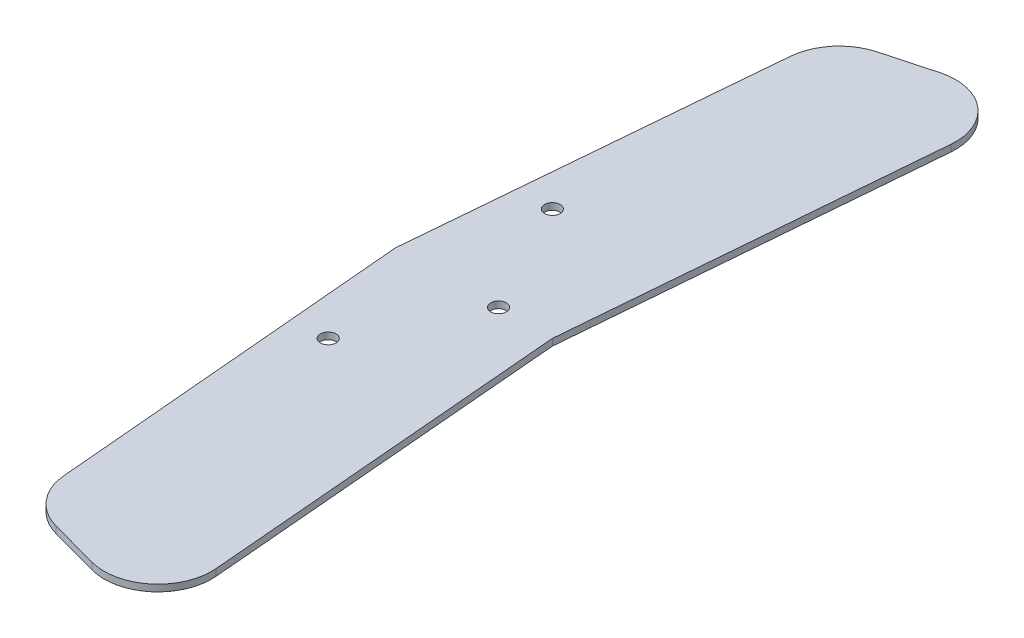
ISO-10303-21;
HEADER;
FILE_DESCRIPTION(('STEP AP214'),'2;1');
FILE_NAME('part.step','',(''),(''),'','','');
FILE_SCHEMA(('AUTOMOTIVE_DESIGN { 1 0 10303 214 1 1 1 1 }'));
ENDSEC;
DATA;
#1=APPLICATION_CONTEXT('core data for automotive mechanical design processes');
#2=APPLICATION_PROTOCOL_DEFINITION('international standard','automotive_design',2000,#1);
#3=PRODUCT_CONTEXT('',#1,'mechanical');
#4=PRODUCT('Part','Part','',(#3));
#5=PRODUCT_RELATED_PRODUCT_CATEGORY('part','',(#4));
#6=PRODUCT_DEFINITION_FORMATION('','',#4);
#7=PRODUCT_DEFINITION_CONTEXT('part definition',#1,'design');
#8=PRODUCT_DEFINITION('design','',#6,#7);
#9=PRODUCT_DEFINITION_SHAPE('','',#8);
#10=(LENGTH_UNIT() NAMED_UNIT(*) SI_UNIT(.MILLI.,.METRE.));
#11=(NAMED_UNIT(*) PLANE_ANGLE_UNIT() SI_UNIT($,.RADIAN.));
#12=(NAMED_UNIT(*) SI_UNIT($,.STERADIAN.) SOLID_ANGLE_UNIT());
#13=UNCERTAINTY_MEASURE_WITH_UNIT(LENGTH_MEASURE(1.E-05),#10,'distance_accuracy_value','');
#14=(GEOMETRIC_REPRESENTATION_CONTEXT(3) GLOBAL_UNCERTAINTY_ASSIGNED_CONTEXT((#13)) GLOBAL_UNIT_ASSIGNED_CONTEXT((#10,
#11,#12)) REPRESENTATION_CONTEXT('',''));
#15=CARTESIAN_POINT('',(0.,0.,0.));
#16=DIRECTION('',(0.,0.,1.));
#17=DIRECTION('',(1.,0.,0.));
#18=AXIS2_PLACEMENT_3D('',#15,#16,#17);
#19=CARTESIAN_POINT('',(19.,1.5,80.));
#20=DIRECTION('',(0.,-1.,0.));
#21=DIRECTION('',(0.,0.,-1.));
#22=AXIS2_PLACEMENT_3D('',#19,#20,#21);
#23=PLANE('',#22);
#24=CARTESIAN_POINT('',(23.,1.5,0.));
#25=DIRECTION('',(0.,1.,0.));
#26=DIRECTION('',(0.,0.,1.));
#27=AXIS2_PLACEMENT_3D('',#24,#25,#26);
#28=CIRCLE('',#27,1.75);
#29=CARTESIAN_POINT('',(23.,1.5,1.75));
#30=VERTEX_POINT('',#29);
#31=EDGE_CURVE('E263',#30,#30,#28,.T.);
#32=ORIENTED_EDGE('',*,*,#31,.F.);
#33=EDGE_LOOP('',(#32));
#34=FACE_BOUND('',#33,.T.);
#35=DIRECTION('',(0.0866075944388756,0.,0.996242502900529));
#36=VECTOR('',#35,1.);
#37=CARTESIAN_POINT('',(0.,1.5,0.));
#38=LINE('',#37,#36);
#39=CARTESIAN_POINT('',(0.,1.5,0.));
#40=VERTEX_POINT('',#39);
#41=CARTESIAN_POINT('',(7.04508996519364,1.5,81.0392911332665));
#42=VERTEX_POINT('',#41);
#43=EDGE_CURVE('E148',#40,#42,#38,.T.);
#44=ORIENTED_EDGE('',*,*,#43,.T.);
#45=CARTESIAN_POINT('',(19.,1.5,80.));
#46=DIRECTION('',(0.,1.,0.));
#47=DIRECTION('',(0.,0.,-1.));
#48=AXIS2_PLACEMENT_3D('',#45,#46,#47);
#49=CIRCLE('',#48,12.);
#50=CARTESIAN_POINT('',(15.8425911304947,1.5,91.5771658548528));
#51=VERTEX_POINT('',#50);
#52=EDGE_CURVE('E121',#42,#51,#49,.T.);
#53=ORIENTED_EDGE('',*,*,#52,.T.);
#54=DIRECTION('',(0.964763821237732,0.,0.263117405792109));
#55=VECTOR('',#54,1.);
#56=CARTESIAN_POINT('',(15.8425911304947,1.5,91.5771658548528));
#57=LINE('',#56,#55);
#58=CARTESIAN_POINT('',(26.8425911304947,1.5,94.5771658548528));
#59=VERTEX_POINT('',#58);
#60=EDGE_CURVE('E151',#51,#59,#57,.T.);
#61=ORIENTED_EDGE('',*,*,#60,.T.);
#62=CARTESIAN_POINT('',(30.,1.5,83.));
#63=DIRECTION('',(0.,1.,0.));
#64=DIRECTION('',(0.,0.,-1.));
#65=AXIS2_PLACEMENT_3D('',#62,#63,#64);
#66=CIRCLE('',#65,12.);
#67=CARTESIAN_POINT('',(41.9570277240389,1.5,81.985363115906));
#68=VERTEX_POINT('',#67);
#69=EDGE_CURVE('E153',#59,#68,#66,.T.);
#70=ORIENTED_EDGE('',*,*,#69,.T.);
#71=DIRECTION('',(-0.0845530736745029,0.,-0.996418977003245));
#72=VECTOR('',#71,1.);
#73=CARTESIAN_POINT('',(35.,1.5,0.));
#74=LINE('',#73,#72);
#75=CARTESIAN_POINT('',(35.,1.5,0.));
#76=VERTEX_POINT('',#75);
#77=EDGE_CURVE('E155',#68,#76,#74,.T.);
#78=ORIENTED_EDGE('',*,*,#77,.T.);
#79=DIRECTION('',(0.0845530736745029,0.,-0.996418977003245));
#80=VECTOR('',#79,1.);
#81=CARTESIAN_POINT('',(35.,1.5,0.));
#82=LINE('',#81,#80);
#83=CARTESIAN_POINT('',(41.9570277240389,1.5,-81.985363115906));
#84=VERTEX_POINT('',#83);
#85=EDGE_CURVE('E157',#76,#84,#82,.T.);
#86=ORIENTED_EDGE('',*,*,#85,.T.);
#87=CARTESIAN_POINT('',(30.,1.5,-83.));
#88=DIRECTION('',(0.,1.,0.));
#89=DIRECTION('',(0.,0.,1.));
#90=AXIS2_PLACEMENT_3D('',#87,#88,#89);
#91=CIRCLE('',#90,12.);
#92=CARTESIAN_POINT('',(26.8425911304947,1.5,-94.5771658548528));
#93=VERTEX_POINT('',#92);
#94=EDGE_CURVE('E159',#84,#93,#91,.T.);
#95=ORIENTED_EDGE('',*,*,#94,.T.);
#96=DIRECTION('',(-0.964763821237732,0.,0.263117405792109));
#97=VECTOR('',#96,1.);
#98=CARTESIAN_POINT('',(15.8425911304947,1.5,-91.5771658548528));
#99=LINE('',#98,#97);
#100=CARTESIAN_POINT('',(15.8425911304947,1.5,-91.5771658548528));
#101=VERTEX_POINT('',#100);
#102=EDGE_CURVE('E161',#93,#101,#99,.T.);
#103=ORIENTED_EDGE('',*,*,#102,.T.);
#104=CARTESIAN_POINT('',(19.,1.5,-80.));
#105=DIRECTION('',(0.,1.,0.));
#106=DIRECTION('',(0.,0.,1.));
#107=AXIS2_PLACEMENT_3D('',#104,#105,#106);
#108=CIRCLE('',#107,12.);
#109=CARTESIAN_POINT('',(7.04508996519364,1.5,-81.0392911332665));
#110=VERTEX_POINT('',#109);
#111=EDGE_CURVE('E50',#101,#110,#108,.T.);
#112=ORIENTED_EDGE('',*,*,#111,.T.);
#113=DIRECTION('',(-0.0866075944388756,0.,0.996242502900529));
#114=VECTOR('',#113,1.);
#115=CARTESIAN_POINT('',(0.,1.5,0.));
#116=LINE('',#115,#114);
#117=EDGE_CURVE('E45',#110,#40,#116,.T.);
#118=ORIENTED_EDGE('',*,*,#117,.T.);
#119=EDGE_LOOP('',(#44,#53,#61,#70,#78,#86,#95,#103,#112,#118));
#120=FACE_BOUND('',#119,.T.);
#121=CARTESIAN_POINT('',(10.,1.5,25.));
#122=DIRECTION('',(0.,1.,0.));
#123=DIRECTION('',(0.,0.,-1.));
#124=AXIS2_PLACEMENT_3D('',#121,#122,#123);
#125=CIRCLE('',#124,1.75);
#126=CARTESIAN_POINT('',(10.,1.5,23.25));
#127=VERTEX_POINT('',#126);
#128=EDGE_CURVE('E126',#127,#127,#125,.T.);
#129=ORIENTED_EDGE('',*,*,#128,.F.);
#130=EDGE_LOOP('',(#129));
#131=FACE_BOUND('',#130,.T.);
#132=CARTESIAN_POINT('',(10.,1.5,-25.));
#133=DIRECTION('',(0.,1.,0.));
#134=DIRECTION('',(0.,0.,1.));
#135=AXIS2_PLACEMENT_3D('',#132,#133,#134);
#136=CIRCLE('',#135,1.75);
#137=CARTESIAN_POINT('',(10.,1.5,-23.25));
#138=VERTEX_POINT('',#137);
#139=EDGE_CURVE('E252',#138,#138,#136,.T.);
#140=ORIENTED_EDGE('',*,*,#139,.F.);
#141=EDGE_LOOP('',(#140));
#142=FACE_BOUND('',#141,.T.);
#143=ADVANCED_FACE('F30',(#34,#120,#131,#142),#23,.F.);
#144=CARTESIAN_POINT('',(19.,0.,80.));
#145=DIRECTION('',(0.,-1.,0.));
#146=DIRECTION('',(0.,0.,-1.));
#147=AXIS2_PLACEMENT_3D('',#144,#145,#146);
#148=PLANE('',#147);
#149=CARTESIAN_POINT('',(23.,0.,0.));
#150=DIRECTION('',(0.,1.,0.));
#151=DIRECTION('',(0.,0.,1.));
#152=AXIS2_PLACEMENT_3D('',#149,#150,#151);
#153=CIRCLE('',#152,1.75);
#154=CARTESIAN_POINT('',(23.,0.,1.75));
#155=VERTEX_POINT('',#154);
#156=EDGE_CURVE('E258',#155,#155,#153,.T.);
#157=ORIENTED_EDGE('',*,*,#156,.T.);
#158=EDGE_LOOP('',(#157));
#159=FACE_BOUND('',#158,.T.);
#160=DIRECTION('',(0.0866075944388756,0.,0.996242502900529));
#161=VECTOR('',#160,1.);
#162=CARTESIAN_POINT('',(0.,0.,0.));
#163=LINE('',#162,#161);
#164=CARTESIAN_POINT('',(0.,0.,0.));
#165=VERTEX_POINT('',#164);
#166=CARTESIAN_POINT('',(7.04508996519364,0.,81.0392911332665));
#167=VERTEX_POINT('',#166);
#168=EDGE_CURVE('E112',#165,#167,#163,.T.);
#169=ORIENTED_EDGE('',*,*,#168,.F.);
#170=DIRECTION('',(-0.0866075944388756,0.,0.996242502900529));
#171=VECTOR('',#170,1.);
#172=CARTESIAN_POINT('',(0.,0.,0.));
#173=LINE('',#172,#171);
#174=CARTESIAN_POINT('',(7.04508996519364,0.,-81.0392911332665));
#175=VERTEX_POINT('',#174);
#176=EDGE_CURVE('E146',#175,#165,#173,.T.);
#177=ORIENTED_EDGE('',*,*,#176,.F.);
#178=CARTESIAN_POINT('',(19.,0.,-80.));
#179=DIRECTION('',(0.,1.,0.));
#180=DIRECTION('',(0.,0.,1.));
#181=AXIS2_PLACEMENT_3D('',#178,#179,#180);
#182=CIRCLE('',#181,12.);
#183=CARTESIAN_POINT('',(15.8425911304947,0.,-91.5771658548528));
#184=VERTEX_POINT('',#183);
#185=EDGE_CURVE('E144',#184,#175,#182,.T.);
#186=ORIENTED_EDGE('',*,*,#185,.F.);
#187=DIRECTION('',(-0.964763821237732,0.,0.263117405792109));
#188=VECTOR('',#187,1.);
#189=CARTESIAN_POINT('',(15.8425911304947,0.,-91.5771658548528));
#190=LINE('',#189,#188);
#191=CARTESIAN_POINT('',(26.8425911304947,0.,-94.5771658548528));
#192=VERTEX_POINT('',#191);
#193=EDGE_CURVE('E142',#192,#184,#190,.T.);
#194=ORIENTED_EDGE('',*,*,#193,.F.);
#195=CARTESIAN_POINT('',(30.,0.,-83.));
#196=DIRECTION('',(0.,1.,0.));
#197=DIRECTION('',(0.,0.,1.));
#198=AXIS2_PLACEMENT_3D('',#195,#196,#197);
#199=CIRCLE('',#198,12.);
#200=CARTESIAN_POINT('',(41.9570277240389,0.,-81.985363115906));
#201=VERTEX_POINT('',#200);
#202=EDGE_CURVE('E140',#201,#192,#199,.T.);
#203=ORIENTED_EDGE('',*,*,#202,.F.);
#204=DIRECTION('',(0.0845530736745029,0.,-0.996418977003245));
#205=VECTOR('',#204,1.);
#206=CARTESIAN_POINT('',(35.,0.,0.));
#207=LINE('',#206,#205);
#208=CARTESIAN_POINT('',(35.,0.,0.));
#209=VERTEX_POINT('',#208);
#210=EDGE_CURVE('E138',#209,#201,#207,.T.);
#211=ORIENTED_EDGE('',*,*,#210,.F.);
#212=DIRECTION('',(-0.0845530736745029,0.,-0.996418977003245));
#213=VECTOR('',#212,1.);
#214=CARTESIAN_POINT('',(35.,0.,0.));
#215=LINE('',#214,#213);
#216=CARTESIAN_POINT('',(41.9570277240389,0.,81.985363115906));
#217=VERTEX_POINT('',#216);
#218=EDGE_CURVE('E136',#217,#209,#215,.T.);
#219=ORIENTED_EDGE('',*,*,#218,.F.);
#220=CARTESIAN_POINT('',(30.,0.,83.));
#221=DIRECTION('',(0.,1.,0.));
#222=DIRECTION('',(0.,0.,-1.));
#223=AXIS2_PLACEMENT_3D('',#220,#221,#222);
#224=CIRCLE('',#223,12.);
#225=CARTESIAN_POINT('',(26.8425911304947,0.,94.5771658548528));
#226=VERTEX_POINT('',#225);
#227=EDGE_CURVE('E134',#226,#217,#224,.T.);
#228=ORIENTED_EDGE('',*,*,#227,.F.);
#229=DIRECTION('',(0.964763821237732,0.,0.263117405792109));
#230=VECTOR('',#229,1.);
#231=CARTESIAN_POINT('',(15.8425911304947,0.,91.5771658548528));
#232=LINE('',#231,#230);
#233=CARTESIAN_POINT('',(15.8425911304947,0.,91.5771658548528));
#234=VERTEX_POINT('',#233);
#235=EDGE_CURVE('E114',#234,#226,#232,.T.);
#236=ORIENTED_EDGE('',*,*,#235,.F.);
#237=CARTESIAN_POINT('',(19.,0.,80.));
#238=DIRECTION('',(0.,1.,0.));
#239=DIRECTION('',(0.,0.,-1.));
#240=AXIS2_PLACEMENT_3D('',#237,#238,#239);
#241=CIRCLE('',#240,12.);
#242=EDGE_CURVE('E107',#167,#234,#241,.T.);
#243=ORIENTED_EDGE('',*,*,#242,.F.);
#244=EDGE_LOOP('',(#169,#177,#186,#194,#203,#211,#219,#228,#236,#243));
#245=FACE_BOUND('',#244,.T.);
#246=CARTESIAN_POINT('',(10.,0.,25.));
#247=DIRECTION('',(0.,1.,0.));
#248=DIRECTION('',(0.,0.,-1.));
#249=AXIS2_PLACEMENT_3D('',#246,#247,#248);
#250=CIRCLE('',#249,1.75);
#251=CARTESIAN_POINT('',(10.,0.,23.25));
#252=VERTEX_POINT('',#251);
#253=EDGE_CURVE('E129',#252,#252,#250,.T.);
#254=ORIENTED_EDGE('',*,*,#253,.T.);
#255=EDGE_LOOP('',(#254));
#256=FACE_BOUND('',#255,.T.);
#257=CARTESIAN_POINT('',(10.,0.,-25.));
#258=DIRECTION('',(0.,1.,0.));
#259=DIRECTION('',(0.,0.,1.));
#260=AXIS2_PLACEMENT_3D('',#257,#258,#259);
#261=CIRCLE('',#260,1.75);
#262=CARTESIAN_POINT('',(10.,0.,-23.25));
#263=VERTEX_POINT('',#262);
#264=EDGE_CURVE('E255',#263,#263,#261,.T.);
#265=ORIENTED_EDGE('',*,*,#264,.T.);
#266=EDGE_LOOP('',(#265));
#267=FACE_BOUND('',#266,.T.);
#268=ADVANCED_FACE('F108',(#159,#245,#256,#267),#148,.T.);
#269=CARTESIAN_POINT('',(0.,1.5,0.));
#270=DIRECTION('',(0.996242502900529,0.,-0.0866075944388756));
#271=DIRECTION('',(-0.0866075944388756,0.,-0.996242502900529));
#272=AXIS2_PLACEMENT_3D('',#269,#270,#271);
#273=PLANE('',#272);
#274=ORIENTED_EDGE('',*,*,#168,.T.);
#275=DIRECTION('',(0.,-1.,0.));
#276=VECTOR('',#275,1.);
#277=CARTESIAN_POINT('',(7.04508996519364,1.5,81.0392911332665));
#278=LINE('',#277,#276);
#279=EDGE_CURVE('E11',#42,#167,#278,.T.);
#280=ORIENTED_EDGE('',*,*,#279,.F.);
#281=ORIENTED_EDGE('',*,*,#43,.F.);
#282=DIRECTION('',(0.,-1.,0.));
#283=VECTOR('',#282,1.);
#284=CARTESIAN_POINT('',(0.,1.5,0.));
#285=LINE('',#284,#283);
#286=EDGE_CURVE('E125',#40,#165,#285,.T.);
#287=ORIENTED_EDGE('',*,*,#286,.T.);
#288=EDGE_LOOP('',(#274,#280,#281,#287));
#289=FACE_BOUND('',#288,.T.);
#290=ADVANCED_FACE('F32',(#289),#273,.F.);
#291=CARTESIAN_POINT('',(19.,1.5,80.));
#292=DIRECTION('',(0.,-1.,0.));
#293=DIRECTION('',(0.,0.,-1.));
#294=AXIS2_PLACEMENT_3D('',#291,#292,#293);
#295=CYLINDRICAL_SURFACE('',#294,12.);
#296=ORIENTED_EDGE('',*,*,#242,.T.);
#297=DIRECTION('',(0.,-1.,0.));
#298=VECTOR('',#297,1.);
#299=CARTESIAN_POINT('',(15.8425911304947,1.5,91.5771658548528));
#300=LINE('',#299,#298);
#301=EDGE_CURVE('E38',#51,#234,#300,.T.);
#302=ORIENTED_EDGE('',*,*,#301,.F.);
#303=ORIENTED_EDGE('',*,*,#52,.F.);
#304=ORIENTED_EDGE('',*,*,#279,.T.);
#305=EDGE_LOOP('',(#296,#302,#303,#304));
#306=FACE_BOUND('',#305,.T.);
#307=ADVANCED_FACE('F120',(#306),#295,.T.);
#308=CARTESIAN_POINT('',(15.8425911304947,1.5,91.5771658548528));
#309=DIRECTION('',(0.263117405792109,0.,-0.964763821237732));
#310=DIRECTION('',(-0.964763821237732,0.,-0.263117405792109));
#311=AXIS2_PLACEMENT_3D('',#308,#309,#310);
#312=PLANE('',#311);
#313=ORIENTED_EDGE('',*,*,#235,.T.);
#314=DIRECTION('',(0.,-1.,0.));
#315=VECTOR('',#314,1.);
#316=CARTESIAN_POINT('',(26.8425911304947,1.5,94.5771658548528));
#317=LINE('',#316,#315);
#318=EDGE_CURVE('E184',#59,#226,#317,.T.);
#319=ORIENTED_EDGE('',*,*,#318,.F.);
#320=ORIENTED_EDGE('',*,*,#60,.F.);
#321=ORIENTED_EDGE('',*,*,#301,.T.);
#322=EDGE_LOOP('',(#313,#319,#320,#321));
#323=FACE_BOUND('',#322,.T.);
#324=ADVANCED_FACE('F188',(#323),#312,.F.);
#325=CARTESIAN_POINT('',(30.,1.5,83.));
#326=DIRECTION('',(0.,-1.,0.));
#327=DIRECTION('',(0.,0.,-1.));
#328=AXIS2_PLACEMENT_3D('',#325,#326,#327);
#329=CYLINDRICAL_SURFACE('',#328,12.);
#330=ORIENTED_EDGE('',*,*,#227,.T.);
#331=DIRECTION('',(0.,-1.,0.));
#332=VECTOR('',#331,1.);
#333=CARTESIAN_POINT('',(41.9570277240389,1.5,81.985363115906));
#334=LINE('',#333,#332);
#335=EDGE_CURVE('E181',#68,#217,#334,.T.);
#336=ORIENTED_EDGE('',*,*,#335,.F.);
#337=ORIENTED_EDGE('',*,*,#69,.F.);
#338=ORIENTED_EDGE('',*,*,#318,.T.);
#339=EDGE_LOOP('',(#330,#336,#337,#338));
#340=FACE_BOUND('',#339,.T.);
#341=ADVANCED_FACE('F196',(#340),#329,.T.);
#342=CARTESIAN_POINT('',(35.,1.5,0.));
#343=DIRECTION('',(-0.996418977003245,0.,0.0845530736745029));
#344=DIRECTION('',(0.0845530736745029,0.,0.996418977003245));
#345=AXIS2_PLACEMENT_3D('',#342,#343,#344);
#346=PLANE('',#345);
#347=ORIENTED_EDGE('',*,*,#218,.T.);
#348=DIRECTION('',(0.,-1.,0.));
#349=VECTOR('',#348,1.);
#350=CARTESIAN_POINT('',(35.,1.5,0.));
#351=LINE('',#350,#349);
#352=EDGE_CURVE('E178',#76,#209,#351,.T.);
#353=ORIENTED_EDGE('',*,*,#352,.F.);
#354=ORIENTED_EDGE('',*,*,#77,.F.);
#355=ORIENTED_EDGE('',*,*,#335,.T.);
#356=EDGE_LOOP('',(#347,#353,#354,#355));
#357=FACE_BOUND('',#356,.T.);
#358=ADVANCED_FACE('F199',(#357),#346,.F.);
#359=CARTESIAN_POINT('',(35.,1.5,0.));
#360=DIRECTION('',(-0.996418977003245,0.,-0.0845530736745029));
#361=DIRECTION('',(-0.0845530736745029,0.,0.996418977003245));
#362=AXIS2_PLACEMENT_3D('',#359,#360,#361);
#363=PLANE('',#362);
#364=ORIENTED_EDGE('',*,*,#210,.T.);
#365=DIRECTION('',(0.,-1.,0.));
#366=VECTOR('',#365,1.);
#367=CARTESIAN_POINT('',(41.9570277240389,1.5,-81.985363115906));
#368=LINE('',#367,#366);
#369=EDGE_CURVE('E175',#84,#201,#368,.T.);
#370=ORIENTED_EDGE('',*,*,#369,.F.);
#371=ORIENTED_EDGE('',*,*,#85,.F.);
#372=ORIENTED_EDGE('',*,*,#352,.T.);
#373=EDGE_LOOP('',(#364,#370,#371,#372));
#374=FACE_BOUND('',#373,.T.);
#375=ADVANCED_FACE('F204',(#374),#363,.F.);
#376=CARTESIAN_POINT('',(30.,1.5,-83.));
#377=DIRECTION('',(0.,-1.,0.));
#378=DIRECTION('',(0.,0.,-1.));
#379=AXIS2_PLACEMENT_3D('',#376,#377,#378);
#380=CYLINDRICAL_SURFACE('',#379,12.);
#381=ORIENTED_EDGE('',*,*,#202,.T.);
#382=DIRECTION('',(0.,-1.,0.));
#383=VECTOR('',#382,1.);
#384=CARTESIAN_POINT('',(26.8425911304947,1.5,-94.5771658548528));
#385=LINE('',#384,#383);
#386=EDGE_CURVE('E172',#93,#192,#385,.T.);
#387=ORIENTED_EDGE('',*,*,#386,.F.);
#388=ORIENTED_EDGE('',*,*,#94,.F.);
#389=ORIENTED_EDGE('',*,*,#369,.T.);
#390=EDGE_LOOP('',(#381,#387,#388,#389));
#391=FACE_BOUND('',#390,.T.);
#392=ADVANCED_FACE('F210',(#391),#380,.T.);
#393=CARTESIAN_POINT('',(15.8425911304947,1.5,-91.5771658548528));
#394=DIRECTION('',(0.263117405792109,0.,0.964763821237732));
#395=DIRECTION('',(0.964763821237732,0.,-0.263117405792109));
#396=AXIS2_PLACEMENT_3D('',#393,#394,#395);
#397=PLANE('',#396);
#398=ORIENTED_EDGE('',*,*,#193,.T.);
#399=DIRECTION('',(0.,-1.,0.));
#400=VECTOR('',#399,1.);
#401=CARTESIAN_POINT('',(15.8425911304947,1.5,-91.5771658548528));
#402=LINE('',#401,#400);
#403=EDGE_CURVE('E169',#101,#184,#402,.T.);
#404=ORIENTED_EDGE('',*,*,#403,.F.);
#405=ORIENTED_EDGE('',*,*,#102,.F.);
#406=ORIENTED_EDGE('',*,*,#386,.T.);
#407=EDGE_LOOP('',(#398,#404,#405,#406));
#408=FACE_BOUND('',#407,.T.);
#409=ADVANCED_FACE('F214',(#408),#397,.F.);
#410=CARTESIAN_POINT('',(19.,1.5,-80.));
#411=DIRECTION('',(0.,-1.,0.));
#412=DIRECTION('',(0.,0.,-1.));
#413=AXIS2_PLACEMENT_3D('',#410,#411,#412);
#414=CYLINDRICAL_SURFACE('',#413,12.);
#415=ORIENTED_EDGE('',*,*,#185,.T.);
#416=DIRECTION('',(0.,-1.,0.));
#417=VECTOR('',#416,1.);
#418=CARTESIAN_POINT('',(7.04508996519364,1.5,-81.0392911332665));
#419=LINE('',#418,#417);
#420=EDGE_CURVE('E166',#110,#175,#419,.T.);
#421=ORIENTED_EDGE('',*,*,#420,.F.);
#422=ORIENTED_EDGE('',*,*,#111,.F.);
#423=ORIENTED_EDGE('',*,*,#403,.T.);
#424=EDGE_LOOP('',(#415,#421,#422,#423));
#425=FACE_BOUND('',#424,.T.);
#426=ADVANCED_FACE('F217',(#425),#414,.T.);
#427=CARTESIAN_POINT('',(0.,1.5,0.));
#428=DIRECTION('',(0.996242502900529,0.,0.0866075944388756));
#429=DIRECTION('',(0.0866075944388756,0.,-0.996242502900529));
#430=AXIS2_PLACEMENT_3D('',#427,#428,#429);
#431=PLANE('',#430);
#432=ORIENTED_EDGE('',*,*,#176,.T.);
#433=ORIENTED_EDGE('',*,*,#286,.F.);
#434=ORIENTED_EDGE('',*,*,#117,.F.);
#435=ORIENTED_EDGE('',*,*,#420,.T.);
#436=EDGE_LOOP('',(#432,#433,#434,#435));
#437=FACE_BOUND('',#436,.T.);
#438=ADVANCED_FACE('F219',(#437),#431,.F.);
#439=CARTESIAN_POINT('',(10.,1.5,25.));
#440=DIRECTION('',(0.,-1.,0.));
#441=DIRECTION('',(0.,0.,-1.));
#442=AXIS2_PLACEMENT_3D('',#439,#440,#441);
#443=CYLINDRICAL_SURFACE('',#442,1.75);
#444=ORIENTED_EDGE('',*,*,#128,.T.);
#445=EDGE_LOOP('',(#444));
#446=FACE_BOUND('',#445,.T.);
#447=ORIENTED_EDGE('',*,*,#253,.F.);
#448=EDGE_LOOP('',(#447));
#449=FACE_BOUND('',#448,.T.);
#450=ADVANCED_FACE('F221',(#446,#449),#443,.F.);
#451=CARTESIAN_POINT('',(23.,1.5,0.));
#452=DIRECTION('',(0.,-1.,0.));
#453=DIRECTION('',(0.,0.,-1.));
#454=AXIS2_PLACEMENT_3D('',#451,#452,#453);
#455=CYLINDRICAL_SURFACE('',#454,1.75);
#456=ORIENTED_EDGE('',*,*,#31,.T.);
#457=EDGE_LOOP('',(#456));
#458=FACE_BOUND('',#457,.T.);
#459=ORIENTED_EDGE('',*,*,#156,.F.);
#460=EDGE_LOOP('',(#459));
#461=FACE_BOUND('',#460,.T.);
#462=ADVANCED_FACE('F227',(#458,#461),#455,.F.);
#463=CARTESIAN_POINT('',(10.,1.5,-25.));
#464=DIRECTION('',(0.,-1.,0.));
#465=DIRECTION('',(0.,0.,-1.));
#466=AXIS2_PLACEMENT_3D('',#463,#464,#465);
#467=CYLINDRICAL_SURFACE('',#466,1.75);
#468=ORIENTED_EDGE('',*,*,#139,.T.);
#469=EDGE_LOOP('',(#468));
#470=FACE_BOUND('',#469,.T.);
#471=ORIENTED_EDGE('',*,*,#264,.F.);
#472=EDGE_LOOP('',(#471));
#473=FACE_BOUND('',#472,.T.);
#474=ADVANCED_FACE('F243',(#470,#473),#467,.F.);
#475=CLOSED_SHELL('',(#143,#268,#290,#307,#324,#341,#358,#375,#392,#409,#426,#438,#450,#462,#474));
#476=MANIFOLD_SOLID_BREP('B2',#475);
#477=ADVANCED_BREP_SHAPE_REPRESENTATION('',(#18,#476),#14);
#478=SHAPE_DEFINITION_REPRESENTATION(#9,#477);
ENDSEC;
END-ISO-10303-21;
